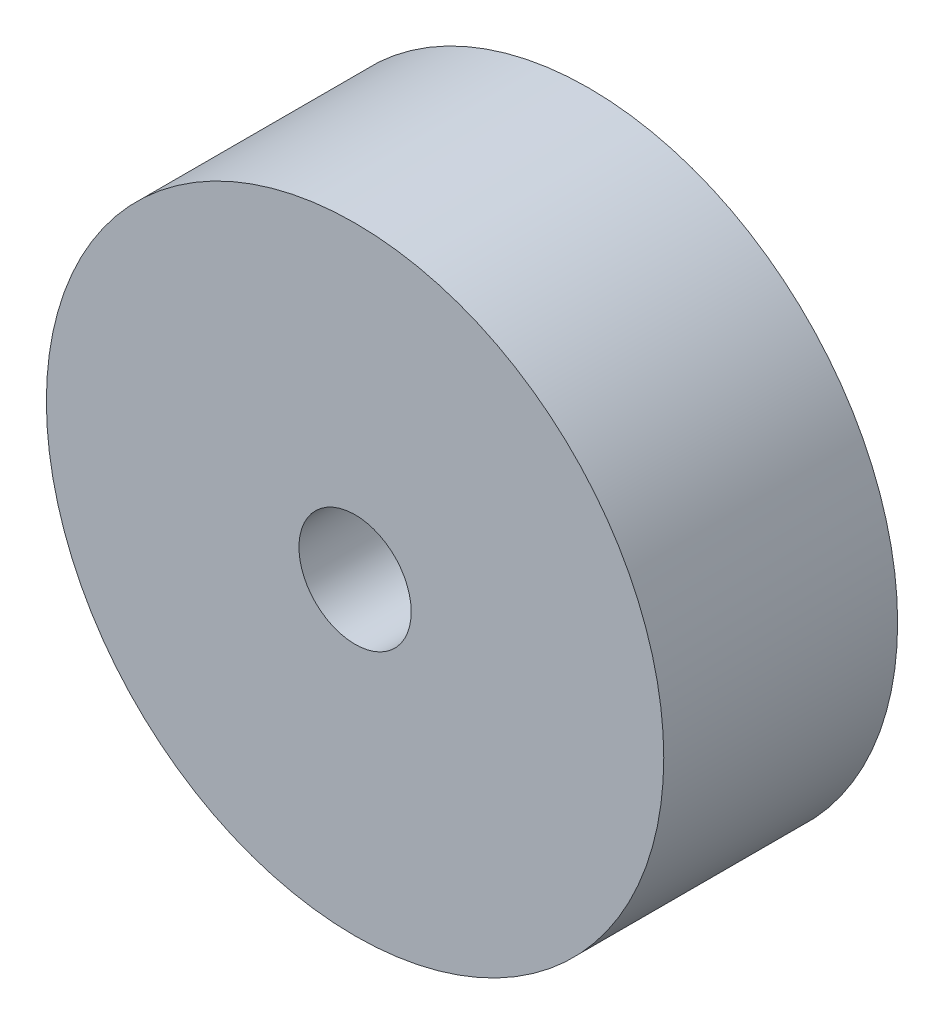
from build123d import *

# Parameters (mm, degrees)
SKETCH1_R           = 33
SKETCH1_R_2         = 6
BOSS_EXTRUDE1_DEPTH = 25


with BuildPart() as part:
    # Sketch1 → Boss-Extrude1 (new body)
    with BuildSketch(Plane.XY):
        Circle(SKETCH1_R)
        Circle(SKETCH1_R_2, mode=Mode.SUBTRACT)
    extrude(amount=-BOSS_EXTRUDE1_DEPTH)


solid = part.part
